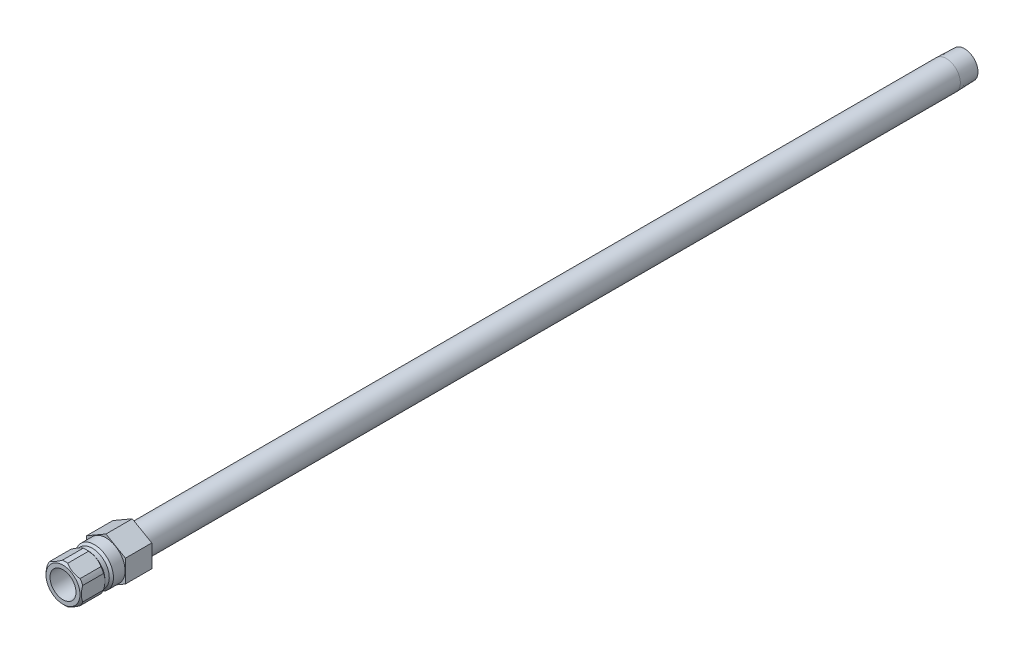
ISO-10303-21;
HEADER;
FILE_DESCRIPTION(('STEP AP214'),'2;1');
FILE_NAME('part.step','',(''),(''),'','','');
FILE_SCHEMA(('AUTOMOTIVE_DESIGN { 1 0 10303 214 1 1 1 1 }'));
ENDSEC;
DATA;
#1=APPLICATION_CONTEXT('core data for automotive mechanical design processes');
#2=APPLICATION_PROTOCOL_DEFINITION('international standard','automotive_design',2000,#1);
#3=PRODUCT_CONTEXT('',#1,'mechanical');
#4=PRODUCT('Part','Part','',(#3));
#5=PRODUCT_RELATED_PRODUCT_CATEGORY('part','',(#4));
#6=PRODUCT_DEFINITION_FORMATION('','',#4);
#7=PRODUCT_DEFINITION_CONTEXT('part definition',#1,'design');
#8=PRODUCT_DEFINITION('design','',#6,#7);
#9=PRODUCT_DEFINITION_SHAPE('','',#8);
#10=(LENGTH_UNIT() NAMED_UNIT(*) SI_UNIT(.MILLI.,.METRE.));
#11=(NAMED_UNIT(*) PLANE_ANGLE_UNIT() SI_UNIT($,.RADIAN.));
#12=(NAMED_UNIT(*) SI_UNIT($,.STERADIAN.) SOLID_ANGLE_UNIT());
#13=UNCERTAINTY_MEASURE_WITH_UNIT(LENGTH_MEASURE(1.E-05),#10,'distance_accuracy_value','');
#14=(GEOMETRIC_REPRESENTATION_CONTEXT(3) GLOBAL_UNCERTAINTY_ASSIGNED_CONTEXT((#13)) GLOBAL_UNIT_ASSIGNED_CONTEXT((#10,
#11,#12)) REPRESENTATION_CONTEXT('',''));
#15=CARTESIAN_POINT('',(0.,0.,0.));
#16=DIRECTION('',(0.,0.,1.));
#17=DIRECTION('',(1.,0.,0.));
#18=AXIS2_PLACEMENT_3D('',#15,#16,#17);
#19=CARTESIAN_POINT('',(0.,0.,-9.652));
#20=DIRECTION('',(0.,0.,-1.));
#21=DIRECTION('',(0.,1.,0.));
#22=AXIS2_PLACEMENT_3D('',#19,#20,#21);
#23=CYLINDRICAL_SURFACE('',#22,6.985);
#24=DIRECTION('',(0.,0.,-1.));
#25=VECTOR('',#24,1.);
#26=CARTESIAN_POINT('',(6.477,2.61509005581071,-9.652));
#27=LINE('',#26,#25);
#28=CARTESIAN_POINT('',(6.477,2.61509005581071,7.366));
#29=VERTEX_POINT('',#28);
#30=CARTESIAN_POINT('',(6.477,2.61509005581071,14.986));
#31=VERTEX_POINT('',#30);
#32=EDGE_CURVE('E372',#29,#31,#27,.F.);
#33=ORIENTED_EDGE('',*,*,#32,.F.);
#34=CARTESIAN_POINT('',(0.,0.,7.366));
#35=DIRECTION('',(0.,0.,-1.));
#36=DIRECTION('',(0.,1.,0.));
#37=AXIS2_PLACEMENT_3D('',#34,#35,#36);
#38=CIRCLE('',#37,6.985);
#39=CARTESIAN_POINT('',(5.50323442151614,4.30170151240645,7.366));
#40=VERTEX_POINT('',#39);
#41=EDGE_CURVE('E190',#40,#29,#38,.T.);
#42=ORIENTED_EDGE('',*,*,#41,.F.);
#43=DIRECTION('',(0.,0.,-1.));
#44=VECTOR('',#43,1.);
#45=CARTESIAN_POINT('',(5.50323442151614,4.30170151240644,-9.652));
#46=LINE('',#45,#44);
#47=CARTESIAN_POINT('',(5.50323442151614,4.30170151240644,14.986));
#48=VERTEX_POINT('',#47);
#49=EDGE_CURVE('E363',#48,#40,#46,.T.);
#50=ORIENTED_EDGE('',*,*,#49,.F.);
#51=CARTESIAN_POINT('',(0.,0.,14.986));
#52=DIRECTION('',(0.,0.,-1.));
#53=DIRECTION('',(0.,1.,0.));
#54=AXIS2_PLACEMENT_3D('',#51,#52,#53);
#55=CIRCLE('',#54,6.985);
#56=EDGE_CURVE('E205',#48,#31,#55,.T.);
#57=ORIENTED_EDGE('',*,*,#56,.T.);
#58=EDGE_LOOP('',(#33,#42,#50,#57));
#59=FACE_BOUND('',#58,.T.);
#60=ADVANCED_FACE('F34',(#59),#23,.T.);
#61=DIRECTION('',(0.,0.,-1.));
#62=VECTOR('',#61,1.);
#63=CARTESIAN_POINT('',(0.97376557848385,6.91679156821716,-9.652));
#64=LINE('',#63,#62);
#65=CARTESIAN_POINT('',(0.973765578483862,6.91679156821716,7.366));
#66=VERTEX_POINT('',#65);
#67=CARTESIAN_POINT('',(0.97376557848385,6.91679156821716,14.986));
#68=VERTEX_POINT('',#67);
#69=EDGE_CURVE('E283',#66,#68,#64,.F.);
#70=ORIENTED_EDGE('',*,*,#69,.F.);
#71=CARTESIAN_POINT('',(-0.973765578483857,6.91679156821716,7.366));
#72=VERTEX_POINT('',#71);
#73=EDGE_CURVE('E194',#72,#66,#38,.T.);
#74=ORIENTED_EDGE('',*,*,#73,.F.);
#75=DIRECTION('',(0.,0.,-1.));
#76=VECTOR('',#75,1.);
#77=CARTESIAN_POINT('',(-0.97376557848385,6.91679156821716,-9.652));
#78=LINE('',#77,#76);
#79=CARTESIAN_POINT('',(-0.97376557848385,6.91679156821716,14.986));
#80=VERTEX_POINT('',#79);
#81=EDGE_CURVE('E54',#80,#72,#78,.T.);
#82=ORIENTED_EDGE('',*,*,#81,.F.);
#83=EDGE_CURVE('E193',#80,#68,#55,.T.);
#84=ORIENTED_EDGE('',*,*,#83,.T.);
#85=EDGE_LOOP('',(#70,#74,#82,#84));
#86=FACE_BOUND('',#85,.T.);
#87=ADVANCED_FACE('F317',(#86),#23,.T.);
#88=DIRECTION('',(0.,0.,-1.));
#89=VECTOR('',#88,1.);
#90=CARTESIAN_POINT('',(-5.50323442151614,4.30170151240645,-9.652));
#91=LINE('',#90,#89);
#92=CARTESIAN_POINT('',(-5.50323442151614,4.30170151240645,7.366));
#93=VERTEX_POINT('',#92);
#94=CARTESIAN_POINT('',(-5.50323442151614,4.30170151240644,14.986));
#95=VERTEX_POINT('',#94);
#96=EDGE_CURVE('E361',#93,#95,#91,.F.);
#97=ORIENTED_EDGE('',*,*,#96,.F.);
#98=CARTESIAN_POINT('',(-6.477,2.6150900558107,7.366));
#99=VERTEX_POINT('',#98);
#100=EDGE_CURVE('E199',#99,#93,#38,.T.);
#101=ORIENTED_EDGE('',*,*,#100,.F.);
#102=DIRECTION('',(0.,0.,-1.));
#103=VECTOR('',#102,1.);
#104=CARTESIAN_POINT('',(-6.477,2.61509005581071,-9.652));
#105=LINE('',#104,#103);
#106=CARTESIAN_POINT('',(-6.477,2.6150900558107,14.986));
#107=VERTEX_POINT('',#106);
#108=EDGE_CURVE('E62',#107,#99,#105,.T.);
#109=ORIENTED_EDGE('',*,*,#108,.F.);
#110=EDGE_CURVE('E204',#107,#95,#55,.T.);
#111=ORIENTED_EDGE('',*,*,#110,.T.);
#112=EDGE_LOOP('',(#97,#101,#109,#111));
#113=FACE_BOUND('',#112,.T.);
#114=ADVANCED_FACE('F322',(#113),#23,.T.);
#115=DIRECTION('',(0.,0.,-1.));
#116=VECTOR('',#115,1.);
#117=CARTESIAN_POINT('',(-6.477,-2.61509005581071,-9.652));
#118=LINE('',#117,#116);
#119=CARTESIAN_POINT('',(-6.477,-2.61509005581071,7.366));
#120=VERTEX_POINT('',#119);
#121=CARTESIAN_POINT('',(-6.477,-2.61509005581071,14.986));
#122=VERTEX_POINT('',#121);
#123=EDGE_CURVE('E353',#120,#122,#118,.F.);
#124=ORIENTED_EDGE('',*,*,#123,.F.);
#125=CARTESIAN_POINT('',(-5.50323442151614,-4.30170151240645,7.366));
#126=VERTEX_POINT('',#125);
#127=EDGE_CURVE('E195',#126,#120,#38,.T.);
#128=ORIENTED_EDGE('',*,*,#127,.F.);
#129=DIRECTION('',(0.,0.,-1.));
#130=VECTOR('',#129,1.);
#131=CARTESIAN_POINT('',(-5.50323442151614,-4.30170151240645,-9.652));
#132=LINE('',#131,#130);
#133=CARTESIAN_POINT('',(-5.50323442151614,-4.30170151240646,14.986));
#134=VERTEX_POINT('',#133);
#135=EDGE_CURVE('E239',#134,#126,#132,.T.);
#136=ORIENTED_EDGE('',*,*,#135,.F.);
#137=EDGE_CURVE('E367',#134,#122,#55,.T.);
#138=ORIENTED_EDGE('',*,*,#137,.T.);
#139=EDGE_LOOP('',(#124,#128,#136,#138));
#140=FACE_BOUND('',#139,.T.);
#141=ADVANCED_FACE('F332',(#140),#23,.T.);
#142=DIRECTION('',(0.,0.,-1.));
#143=VECTOR('',#142,1.);
#144=CARTESIAN_POINT('',(-0.973765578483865,-6.91679156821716,-9.652));
#145=LINE('',#144,#143);
#146=CARTESIAN_POINT('',(-0.973765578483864,-6.91679156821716,7.366));
#147=VERTEX_POINT('',#146);
#148=CARTESIAN_POINT('',(-0.973765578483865,-6.91679156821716,14.986));
#149=VERTEX_POINT('',#148);
#150=EDGE_CURVE('E342',#147,#149,#145,.F.);
#151=ORIENTED_EDGE('',*,*,#150,.F.);
#152=CARTESIAN_POINT('',(0.973765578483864,-6.91679156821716,7.366));
#153=VERTEX_POINT('',#152);
#154=EDGE_CURVE('E191',#153,#147,#38,.T.);
#155=ORIENTED_EDGE('',*,*,#154,.F.);
#156=DIRECTION('',(0.,0.,-1.));
#157=VECTOR('',#156,1.);
#158=CARTESIAN_POINT('',(0.973765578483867,-6.91679156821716,-9.652));
#159=LINE('',#158,#157);
#160=CARTESIAN_POINT('',(0.973765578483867,-6.91679156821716,14.986));
#161=VERTEX_POINT('',#160);
#162=EDGE_CURVE('E168',#161,#153,#159,.T.);
#163=ORIENTED_EDGE('',*,*,#162,.F.);
#164=EDGE_CURVE('E344',#161,#149,#55,.T.);
#165=ORIENTED_EDGE('',*,*,#164,.T.);
#166=EDGE_LOOP('',(#151,#155,#163,#165));
#167=FACE_BOUND('',#166,.T.);
#168=ADVANCED_FACE('F326',(#167),#23,.T.);
#169=CARTESIAN_POINT('',(0.,0.,-9.652));
#170=DIRECTION('',(0.,0.,-1.));
#171=DIRECTION('',(0.,1.,0.));
#172=AXIS2_PLACEMENT_3D('',#169,#170,#171);
#173=CYLINDRICAL_SURFACE('',#172,4.7625);
#174=CARTESIAN_POINT('',(0.,0.,3.556));
#175=DIRECTION('',(0.,0.,-1.));
#176=DIRECTION('',(0.,1.,0.));
#177=AXIS2_PLACEMENT_3D('',#174,#175,#176);
#178=CIRCLE('',#177,4.7625);
#179=CARTESIAN_POINT('',(0.,4.7625,3.556));
#180=VERTEX_POINT('',#179);
#181=EDGE_CURVE('E420',#180,#180,#178,.T.);
#182=ORIENTED_EDGE('',*,*,#181,.T.);
#183=EDGE_LOOP('',(#182));
#184=FACE_BOUND('',#183,.T.);
#185=CARTESIAN_POINT('',(0.,0.,15.748));
#186=DIRECTION('',(0.,0.,-1.));
#187=DIRECTION('',(0.,1.,0.));
#188=AXIS2_PLACEMENT_3D('',#185,#186,#187);
#189=CIRCLE('',#188,4.7625);
#190=CARTESIAN_POINT('',(0.,4.7625,15.748));
#191=VERTEX_POINT('',#190);
#192=EDGE_CURVE('E209',#191,#191,#189,.T.);
#193=ORIENTED_EDGE('',*,*,#192,.F.);
#194=EDGE_LOOP('',(#193));
#195=FACE_BOUND('',#194,.T.);
#196=ADVANCED_FACE('F36',(#184,#195),#173,.F.);
#197=CARTESIAN_POINT('',(0.,4.7625,15.748));
#198=DIRECTION('',(0.,0.,1.));
#199=DIRECTION('',(0.,-1.,0.));
#200=AXIS2_PLACEMENT_3D('',#197,#198,#199);
#201=PLANE('',#200);
#202=ORIENTED_EDGE('',*,*,#192,.T.);
#203=EDGE_LOOP('',(#202));
#204=FACE_BOUND('',#203,.T.);
#205=CARTESIAN_POINT('',(0.,0.,15.748));
#206=DIRECTION('',(0.,0.,-1.));
#207=DIRECTION('',(0.,1.,0.));
#208=AXIS2_PLACEMENT_3D('',#205,#206,#207);
#209=CIRCLE('',#208,6.223);
#210=CARTESIAN_POINT('',(0.,6.223,15.748));
#211=VERTEX_POINT('',#210);
#212=EDGE_CURVE('E206',#211,#211,#209,.T.);
#213=ORIENTED_EDGE('',*,*,#212,.F.);
#214=EDGE_LOOP('',(#213));
#215=FACE_BOUND('',#214,.T.);
#216=ADVANCED_FACE('F245',(#204,#215),#201,.T.);
#217=CARTESIAN_POINT('',(0.,0.,14.986));
#218=DIRECTION('',(0.,0.,-1.));
#219=DIRECTION('',(0.,1.,0.));
#220=AXIS2_PLACEMENT_3D('',#217,#218,#219);
#221=CONICAL_SURFACE('',#220,6.985,0.785398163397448);
#222=CARTESIAN_POINT('',(6.477,-7.50531717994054,12.0573066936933));
#223=CARTESIAN_POINT('',(6.477,-7.32278230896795,12.1954662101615));
#224=CARTESIAN_POINT('',(6.477,-7.13923073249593,12.3323042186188));
#225=CARTESIAN_POINT('',(6.477,-6.76969107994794,12.6027438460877));
#226=CARTESIAN_POINT('',(6.477,-6.58370240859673,12.7363446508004));
#227=CARTESIAN_POINT('',(6.477,-6.20752484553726,13.0006667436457));
#228=CARTESIAN_POINT('',(6.477,-6.01731457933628,13.1313577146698));
#229=CARTESIAN_POINT('',(6.477,-5.63367369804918,13.3879087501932));
#230=CARTESIAN_POINT('',(6.477,-5.44024331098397,13.5137691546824));
#231=CARTESIAN_POINT('',(6.477,-5.03831720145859,13.7667102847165));
#232=CARTESIAN_POINT('',(6.477,-4.82959841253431,13.8934383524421));
#233=CARTESIAN_POINT('',(6.477,-4.4072839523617,14.1386241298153));
#234=CARTESIAN_POINT('',(6.477,-4.19368750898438,14.2570805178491));
#235=CARTESIAN_POINT('',(6.477,-3.76162676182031,14.4831715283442));
#236=CARTESIAN_POINT('',(6.477,-3.54317924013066,14.5908379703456));
#237=CARTESIAN_POINT('',(6.477,-3.10029556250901,14.7929384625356));
#238=CARTESIAN_POINT('',(6.477,-2.87586219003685,14.8873785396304));
#239=CARTESIAN_POINT('',(6.477,-2.43955826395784,15.0524966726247));
#240=CARTESIAN_POINT('',(6.477,-2.22819339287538,15.1244971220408));
#241=CARTESIAN_POINT('',(6.477,-1.80033354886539,15.2515475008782));
#242=CARTESIAN_POINT('',(6.477,-1.58383822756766,15.3065962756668));
#243=CARTESIAN_POINT('',(6.477,-1.1506339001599,15.3959385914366));
#244=CARTESIAN_POINT('',(6.477,-0.934000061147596,15.4305906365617));
#245=CARTESIAN_POINT('',(6.477,-0.498364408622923,15.4784594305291));
#246=CARTESIAN_POINT('',(6.477,-0.2793630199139,15.4916799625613));
#247=CARTESIAN_POINT('',(6.477,0.150697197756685,15.4956835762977));
#248=CARTESIAN_POINT('',(6.477,0.361748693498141,15.4872823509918));
#249=CARTESIAN_POINT('',(6.477,0.782066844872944,15.4503172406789));
#250=CARTESIAN_POINT('',(6.477,0.991333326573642,15.421751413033));
#251=CARTESIAN_POINT('',(6.477,1.41010575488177,15.3455375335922));
#252=CARTESIAN_POINT('',(6.477,1.6195513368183,15.2975631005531));
#253=CARTESIAN_POINT('',(6.477,2.03387291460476,15.1851046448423));
#254=CARTESIAN_POINT('',(6.477,2.23874927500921,15.1206219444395));
#255=CARTESIAN_POINT('',(6.477,2.66141718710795,14.9715598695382));
#256=CARTESIAN_POINT('',(6.477,2.87875617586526,14.8857103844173));
#257=CARTESIAN_POINT('',(6.477,3.30779766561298,14.7008180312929));
#258=CARTESIAN_POINT('',(6.477,3.51949749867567,14.6017690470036));
#259=CARTESIAN_POINT('',(6.477,3.93828980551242,14.3928329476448));
#260=CARTESIAN_POINT('',(6.477,4.14536521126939,14.282911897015));
#261=CARTESIAN_POINT('',(6.477,4.55475391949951,14.0546596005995));
#262=CARTESIAN_POINT('',(6.477,4.75706796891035,13.93632968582));
#263=CARTESIAN_POINT('',(6.477,5.14761370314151,13.6989609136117));
#264=CARTESIAN_POINT('',(6.477,5.33604552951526,13.580249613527));
#265=CARTESIAN_POINT('',(6.477,5.70967381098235,13.3378251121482));
#266=CARTESIAN_POINT('',(6.477,5.89487001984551,13.2141115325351));
#267=CARTESIAN_POINT('',(6.477,6.26095063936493,12.9635958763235));
#268=CARTESIAN_POINT('',(6.477,6.4418578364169,12.8368269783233));
#269=CARTESIAN_POINT('',(6.477,6.80119835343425,12.5799293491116));
#270=CARTESIAN_POINT('',(6.477,6.97963234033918,12.4498015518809));
#271=CARTESIAN_POINT('',(6.477,7.15703038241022,12.3183002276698));
#272=B_SPLINE_CURVE_WITH_KNOTS('',3,(#222,#223,#224,#225,#226,#227,#228,#229,#230,#231,#232,
#233,#234,#235,#236,#237,#238,#239,#240,#241,#242,#243,#244,#245,#246,#247,#248,#249,#250,#251,
#252,#253,#254,#255,#256,#257,#258,#259,#260,#261,#262,#263,#264,#265,#266,#267,#268,#269,#270,
#271),.UNSPECIFIED.,.F.,.F.,(4,2,2,2,2,2,2,2,2,2,2,2,2,2,2,2,2,2,2,2,2,2,2,2,4),(0.,
0.68679090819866,1.37375281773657,2.06603541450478,2.75826919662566,3.49065471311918,
4.22315698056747,4.95343127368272,5.68337170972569,6.35265989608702,7.02199365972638,
7.67918147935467,8.33625327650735,8.96890298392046,9.60161364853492,10.2454384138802,
10.8892116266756,11.5897073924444,12.2905288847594,12.9936114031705,13.696582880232,
14.3646145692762,15.0326968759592,15.6953618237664,16.3578444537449),.UNSPECIFIED.);
#273=CARTESIAN_POINT('',(6.477,-2.61509005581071,14.986));
#274=VERTEX_POINT('',#273);
#275=EDGE_CURVE('E375',#31,#274,#272,.F.);
#276=ORIENTED_EDGE('',*,*,#275,.F.);
#277=ORIENTED_EDGE('',*,*,#56,.F.);
#278=CARTESIAN_POINT('',(0.973302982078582,6.91705864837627,14.9858));
#279=CARTESIAN_POINT('',(1.1543052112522,6.81255696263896,15.0641166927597));
#280=CARTESIAN_POINT('',(1.3378209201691,6.70660411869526,15.1353544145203));
#281=CARTESIAN_POINT('',(1.70963160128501,6.49193912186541,15.2608524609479));
#282=CARTESIAN_POINT('',(1.89793754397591,6.38322063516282,15.3150691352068));
#283=CARTESIAN_POINT('',(2.27146153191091,6.16756646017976,15.401724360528));
#284=CARTESIAN_POINT('',(2.45655498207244,6.06070270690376,15.4348622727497));
#285=CARTESIAN_POINT('',(2.82844640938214,5.8459910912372,15.4802195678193));
#286=CARTESIAN_POINT('',(3.0152419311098,5.73814464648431,15.4924653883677));
#287=CARTESIAN_POINT('',(3.3948057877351,5.51900335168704,15.4953056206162));
#288=CARTESIAN_POINT('',(3.58757842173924,5.40770601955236,15.4852117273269));
#289=CARTESIAN_POINT('',(3.97148128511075,5.18605959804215,15.4426708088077));
#290=CARTESIAN_POINT('',(4.16260891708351,5.0757120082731,15.4101933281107));
#291=CARTESIAN_POINT('',(4.54854122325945,4.85289388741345,15.3234273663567));
#292=CARTESIAN_POINT('',(4.74321398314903,4.74049951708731,15.268364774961));
#293=CARTESIAN_POINT('',(5.03141021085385,4.5741093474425,15.1720079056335));
#294=CARTESIAN_POINT('',(5.12673323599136,4.51907457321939,15.1376422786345));
#295=CARTESIAN_POINT('',(5.31613879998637,4.40972121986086,15.0647445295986));
#296=CARTESIAN_POINT('',(5.41022179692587,4.35540237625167,15.0262139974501));
#297=CARTESIAN_POINT('',(5.50369701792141,4.30143443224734,14.9858));
#298=B_SPLINE_CURVE_WITH_KNOTS('',3,(#278,#279,#280,#281,#282,#283,#284,#285,#286,#287,#288,
#289,#290,#291,#292,#293,#294,#295,#296,#297),.UNSPECIFIED.,.F.,.F.,(4,2,2,2,2,2,2,2,2,4),(0.,
0.669810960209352,1.34132587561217,1.98920541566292,2.63626449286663,3.30353665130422,
3.97171850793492,4.66502165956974,5.01088265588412,5.35661208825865),.UNSPECIFIED.);
#299=EDGE_CURVE('E275',#68,#48,#298,.T.);
#300=ORIENTED_EDGE('',*,*,#299,.F.);
#301=ORIENTED_EDGE('',*,*,#83,.F.);
#302=CARTESIAN_POINT('',(-5.50369701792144,4.30143443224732,14.9858));
#303=CARTESIAN_POINT('',(-5.32269478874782,4.40593611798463,15.0641166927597));
#304=CARTESIAN_POINT('',(-5.13917907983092,4.51188896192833,15.1353544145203));
#305=CARTESIAN_POINT('',(-4.76736839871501,4.72655395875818,15.2608524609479));
#306=CARTESIAN_POINT('',(-4.57906245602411,4.83527244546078,15.3150691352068));
#307=CARTESIAN_POINT('',(-4.2055384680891,5.05092662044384,15.401724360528));
#308=CARTESIAN_POINT('',(-4.02044501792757,5.15779037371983,15.4348622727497));
#309=CARTESIAN_POINT('',(-3.64855359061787,5.3725019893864,15.4802195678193));
#310=CARTESIAN_POINT('',(-3.46175806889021,5.48034843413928,15.4924653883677));
#311=CARTESIAN_POINT('',(-3.0821942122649,5.69948972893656,15.4953056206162));
#312=CARTESIAN_POINT('',(-2.88942157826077,5.81078706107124,15.4852117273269));
#313=CARTESIAN_POINT('',(-2.50551871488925,6.03243348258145,15.4426708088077));
#314=CARTESIAN_POINT('',(-2.31439108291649,6.1427810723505,15.4101933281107));
#315=CARTESIAN_POINT('',(-1.92845877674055,6.36559919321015,15.3234273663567));
#316=CARTESIAN_POINT('',(-1.73378601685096,6.47799356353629,15.268364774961));
#317=CARTESIAN_POINT('',(-1.44558978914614,6.64438373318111,15.1720079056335));
#318=CARTESIAN_POINT('',(-1.35026676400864,6.69941850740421,15.1376422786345));
#319=CARTESIAN_POINT('',(-1.16086120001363,6.80877186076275,15.0647445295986));
#320=CARTESIAN_POINT('',(-1.06677820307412,6.86309070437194,15.0262139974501));
#321=CARTESIAN_POINT('',(-0.973302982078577,6.91705864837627,14.9858));
#322=B_SPLINE_CURVE_WITH_KNOTS('',3,(#302,#303,#304,#305,#306,#307,#308,#309,#310,#311,#312,
#313,#314,#315,#316,#317,#318,#319,#320,#321),.UNSPECIFIED.,.F.,.F.,(4,2,2,2,2,2,2,2,2,4),(0.,
0.669810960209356,1.34132587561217,1.98920541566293,2.63626449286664,3.30353665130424,
3.97171850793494,4.66502165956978,5.01088265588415,5.35661208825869),.UNSPECIFIED.);
#323=EDGE_CURVE('E267',#95,#80,#322,.T.);
#324=ORIENTED_EDGE('',*,*,#323,.F.);
#325=ORIENTED_EDGE('',*,*,#110,.F.);
#326=CARTESIAN_POINT('',(-6.477,-7.50531717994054,12.0573066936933));
#327=CARTESIAN_POINT('',(-6.477,-7.32278230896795,12.1954662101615));
#328=CARTESIAN_POINT('',(-6.477,-7.13923073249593,12.3323042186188));
#329=CARTESIAN_POINT('',(-6.477,-6.76969107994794,12.6027438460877));
#330=CARTESIAN_POINT('',(-6.477,-6.58370240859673,12.7363446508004));
#331=CARTESIAN_POINT('',(-6.477,-6.20752484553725,13.0006667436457));
#332=CARTESIAN_POINT('',(-6.477,-6.01731457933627,13.1313577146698));
#333=CARTESIAN_POINT('',(-6.477,-5.63367369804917,13.3879087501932));
#334=CARTESIAN_POINT('',(-6.477,-5.44024331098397,13.5137691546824));
#335=CARTESIAN_POINT('',(-6.477,-5.03831720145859,13.7667102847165));
#336=CARTESIAN_POINT('',(-6.477,-4.8295984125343,13.8934383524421));
#337=CARTESIAN_POINT('',(-6.477,-4.4072839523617,14.1386241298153));
#338=CARTESIAN_POINT('',(-6.477,-4.19368750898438,14.2570805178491));
#339=CARTESIAN_POINT('',(-6.477,-3.7616267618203,14.4831715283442));
#340=CARTESIAN_POINT('',(-6.477,-3.54317924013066,14.5908379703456));
#341=CARTESIAN_POINT('',(-6.477,-3.100295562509,14.7929384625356));
#342=CARTESIAN_POINT('',(-6.477,-2.87586219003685,14.8873785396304));
#343=CARTESIAN_POINT('',(-6.477,-2.43955826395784,15.0524966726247));
#344=CARTESIAN_POINT('',(-6.477,-2.22819339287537,15.1244971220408));
#345=CARTESIAN_POINT('',(-6.477,-1.80033354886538,15.2515475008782));
#346=CARTESIAN_POINT('',(-6.477,-1.58383822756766,15.3065962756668));
#347=CARTESIAN_POINT('',(-6.477,-1.15063390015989,15.3959385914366));
#348=CARTESIAN_POINT('',(-6.477,-0.934000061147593,15.4305906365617));
#349=CARTESIAN_POINT('',(-6.477,-0.498364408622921,15.4784594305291));
#350=CARTESIAN_POINT('',(-6.477,-0.279363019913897,15.4916799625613));
#351=CARTESIAN_POINT('',(-6.477,0.150697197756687,15.4956835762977));
#352=CARTESIAN_POINT('',(-6.477,0.361748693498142,15.4872823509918));
#353=CARTESIAN_POINT('',(-6.477,0.782066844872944,15.4503172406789));
#354=CARTESIAN_POINT('',(-6.477,0.991333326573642,15.421751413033));
#355=CARTESIAN_POINT('',(-6.477,1.41010575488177,15.3455375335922));
#356=CARTESIAN_POINT('',(-6.477,1.6195513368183,15.2975631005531));
#357=CARTESIAN_POINT('',(-6.477,2.03387291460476,15.1851046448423));
#358=CARTESIAN_POINT('',(-6.477,2.23874927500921,15.1206219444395));
#359=CARTESIAN_POINT('',(-6.477,2.66141718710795,14.9715598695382));
#360=CARTESIAN_POINT('',(-6.477,2.87875617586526,14.8857103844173));
#361=CARTESIAN_POINT('',(-6.477,3.30779766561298,14.7008180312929));
#362=CARTESIAN_POINT('',(-6.477,3.51949749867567,14.6017690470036));
#363=CARTESIAN_POINT('',(-6.477,3.93828980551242,14.3928329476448));
#364=CARTESIAN_POINT('',(-6.477,4.14536521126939,14.282911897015));
#365=CARTESIAN_POINT('',(-6.477,4.55475391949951,14.0546596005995));
#366=CARTESIAN_POINT('',(-6.477,4.75706796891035,13.93632968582));
#367=CARTESIAN_POINT('',(-6.477,5.14761370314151,13.6989609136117));
#368=CARTESIAN_POINT('',(-6.477,5.33604552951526,13.580249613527));
#369=CARTESIAN_POINT('',(-6.477,5.70967381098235,13.3378251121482));
#370=CARTESIAN_POINT('',(-6.477,5.89487001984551,13.2141115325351));
#371=CARTESIAN_POINT('',(-6.477,6.26095063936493,12.9635958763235));
#372=CARTESIAN_POINT('',(-6.477,6.4418578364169,12.8368269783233));
#373=CARTESIAN_POINT('',(-6.477,6.80119835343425,12.5799293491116));
#374=CARTESIAN_POINT('',(-6.477,6.97963234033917,12.4498015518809));
#375=CARTESIAN_POINT('',(-6.477,7.15703038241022,12.3183002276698));
#376=B_SPLINE_CURVE_WITH_KNOTS('',3,(#326,#327,#328,#329,#330,#331,#332,#333,#334,#335,#336,
#337,#338,#339,#340,#341,#342,#343,#344,#345,#346,#347,#348,#349,#350,#351,#352,#353,#354,#355,
#356,#357,#358,#359,#360,#361,#362,#363,#364,#365,#366,#367,#368,#369,#370,#371,#372,#373,#374,
#375),.UNSPECIFIED.,.F.,.F.,(4,2,2,2,2,2,2,2,2,2,2,2,2,2,2,2,2,2,2,2,2,2,2,2,4),(0.,
0.686790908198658,1.37375281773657,2.06603541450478,2.75826919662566,3.49065471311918,
4.22315698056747,4.95343127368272,5.68337170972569,6.35265989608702,7.02199365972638,
7.67918147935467,8.33625327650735,8.96890298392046,9.60161364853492,10.2454384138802,
10.8892116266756,11.5897073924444,12.2905288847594,12.9936114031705,13.696582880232,
14.3646145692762,15.0326968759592,15.6953618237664,16.3578444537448),.UNSPECIFIED.);
#377=EDGE_CURVE('E260',#122,#107,#376,.T.);
#378=ORIENTED_EDGE('',*,*,#377,.F.);
#379=ORIENTED_EDGE('',*,*,#137,.F.);
#380=CARTESIAN_POINT('',(-0.973302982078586,-6.91705864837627,14.9858));
#381=CARTESIAN_POINT('',(-1.1543052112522,-6.81255696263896,15.0641166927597));
#382=CARTESIAN_POINT('',(-1.3378209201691,-6.70660411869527,15.1353544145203));
#383=CARTESIAN_POINT('',(-1.70963160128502,-6.49193912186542,15.2608524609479));
#384=CARTESIAN_POINT('',(-1.89793754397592,-6.38322063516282,15.3150691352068));
#385=CARTESIAN_POINT('',(-2.27146153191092,-6.16756646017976,15.401724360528));
#386=CARTESIAN_POINT('',(-2.45655498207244,-6.06070270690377,15.4348622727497));
#387=CARTESIAN_POINT('',(-2.82844640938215,-5.8459910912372,15.4802195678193));
#388=CARTESIAN_POINT('',(-3.0152419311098,-5.73814464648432,15.4924653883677));
#389=CARTESIAN_POINT('',(-3.39480578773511,-5.51900335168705,15.4953056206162));
#390=CARTESIAN_POINT('',(-3.58757842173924,-5.40770601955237,15.4852117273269));
#391=CARTESIAN_POINT('',(-3.97148128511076,-5.18605959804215,15.4426708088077));
#392=CARTESIAN_POINT('',(-4.16260891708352,-5.0757120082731,15.4101933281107));
#393=CARTESIAN_POINT('',(-4.54854122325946,-4.85289388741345,15.3234273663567));
#394=CARTESIAN_POINT('',(-4.74321398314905,-4.74049951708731,15.268364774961));
#395=CARTESIAN_POINT('',(-5.03141021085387,-4.57410934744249,15.1720079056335));
#396=CARTESIAN_POINT('',(-5.12673323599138,-4.51907457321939,15.1376422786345));
#397=CARTESIAN_POINT('',(-5.31613879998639,-4.40972121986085,15.0647445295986));
#398=CARTESIAN_POINT('',(-5.4102217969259,-4.35540237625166,15.0262139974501));
#399=CARTESIAN_POINT('',(-5.50369701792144,-4.30143443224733,14.9858));
#400=B_SPLINE_CURVE_WITH_KNOTS('',3,(#380,#381,#382,#383,#384,#385,#386,#387,#388,#389,#390,
#391,#392,#393,#394,#395,#396,#397,#398,#399),.UNSPECIFIED.,.F.,.F.,(4,2,2,2,2,2,2,2,2,4),(0.,
0.669810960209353,1.34132587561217,1.98920541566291,2.63626449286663,3.30353665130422,
3.97171850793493,4.66502165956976,5.01088265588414,5.35661208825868),.UNSPECIFIED.);
#401=EDGE_CURVE('E253',#149,#134,#400,.T.);
#402=ORIENTED_EDGE('',*,*,#401,.F.);
#403=ORIENTED_EDGE('',*,*,#164,.F.);
#404=CARTESIAN_POINT('',(5.50369701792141,-4.30143443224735,14.9858));
#405=CARTESIAN_POINT('',(5.32269478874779,-4.40593611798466,15.0641166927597));
#406=CARTESIAN_POINT('',(5.13917907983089,-4.51188896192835,15.1353544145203));
#407=CARTESIAN_POINT('',(4.76736839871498,-4.7265539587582,15.2608524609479));
#408=CARTESIAN_POINT('',(4.57906245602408,-4.8352724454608,15.3150691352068));
#409=CARTESIAN_POINT('',(4.20553846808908,-5.05092662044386,15.401724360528));
#410=CARTESIAN_POINT('',(4.02044501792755,-5.15779037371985,15.4348622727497));
#411=CARTESIAN_POINT('',(3.64855359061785,-5.37250198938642,15.4802195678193));
#412=CARTESIAN_POINT('',(3.46175806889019,-5.4803484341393,15.4924653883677));
#413=CARTESIAN_POINT('',(3.08219421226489,-5.69948972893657,15.4953056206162));
#414=CARTESIAN_POINT('',(2.88942157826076,-5.81078706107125,15.4852117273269));
#415=CARTESIAN_POINT('',(2.50551871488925,-6.03243348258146,15.4426708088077));
#416=CARTESIAN_POINT('',(2.31439108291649,-6.14278107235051,15.4101933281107));
#417=CARTESIAN_POINT('',(1.92845877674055,-6.36559919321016,15.3234273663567));
#418=CARTESIAN_POINT('',(1.73378601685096,-6.4779935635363,15.268364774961));
#419=CARTESIAN_POINT('',(1.44558978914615,-6.64438373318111,15.1720079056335));
#420=CARTESIAN_POINT('',(1.35026676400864,-6.69941850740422,15.1376422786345));
#421=CARTESIAN_POINT('',(1.16086120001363,-6.80877186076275,15.0647445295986));
#422=CARTESIAN_POINT('',(1.06677820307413,-6.86309070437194,15.0262139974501));
#423=CARTESIAN_POINT('',(0.973302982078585,-6.91705864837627,14.9858));
#424=B_SPLINE_CURVE_WITH_KNOTS('',3,(#404,#405,#406,#407,#408,#409,#410,#411,#412,#413,#414,
#415,#416,#417,#418,#419,#420,#421,#422,#423),.UNSPECIFIED.,.F.,.F.,(4,2,2,2,2,2,2,2,2,4),(0.,
0.669810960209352,1.34132587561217,1.98920541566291,2.63626449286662,3.30353665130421,
3.9717185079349,4.66502165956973,5.0108826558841,5.35661208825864),.UNSPECIFIED.);
#425=CARTESIAN_POINT('',(5.50323442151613,-4.30170151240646,14.986));
#426=VERTEX_POINT('',#425);
#427=EDGE_CURVE('E184',#426,#161,#424,.T.);
#428=ORIENTED_EDGE('',*,*,#427,.F.);
#429=EDGE_CURVE('E183',#274,#426,#55,.T.);
#430=ORIENTED_EDGE('',*,*,#429,.F.);
#431=EDGE_LOOP('',(#276,#277,#300,#301,#324,#325,#378,#379,#402,#403,#428,#430));
#432=FACE_BOUND('',#431,.T.);
#433=ORIENTED_EDGE('',*,*,#212,.T.);
#434=EDGE_LOOP('',(#433));
#435=FACE_BOUND('',#434,.T.);
#436=ADVANCED_FACE('F242',(#432,#435),#221,.T.);
#437=DIRECTION('',(0.,0.,-1.));
#438=VECTOR('',#437,1.);
#439=CARTESIAN_POINT('',(6.477,-2.61509005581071,-9.652));
#440=LINE('',#439,#438);
#441=CARTESIAN_POINT('',(6.477,-2.61509005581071,7.366));
#442=VERTEX_POINT('',#441);
#443=EDGE_CURVE('E282',#274,#442,#440,.T.);
#444=ORIENTED_EDGE('',*,*,#443,.F.);
#445=ORIENTED_EDGE('',*,*,#429,.T.);
#446=DIRECTION('',(0.,0.,-1.));
#447=VECTOR('',#446,1.);
#448=CARTESIAN_POINT('',(5.50323442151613,-4.30170151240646,-9.652));
#449=LINE('',#448,#447);
#450=CARTESIAN_POINT('',(5.50323442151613,-4.30170151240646,7.366));
#451=VERTEX_POINT('',#450);
#452=EDGE_CURVE('E165',#451,#426,#449,.F.);
#453=ORIENTED_EDGE('',*,*,#452,.F.);
#454=EDGE_CURVE('E181',#442,#451,#38,.T.);
#455=ORIENTED_EDGE('',*,*,#454,.F.);
#456=EDGE_LOOP('',(#444,#445,#453,#455));
#457=FACE_BOUND('',#456,.T.);
#458=ADVANCED_FACE('F180',(#457),#23,.T.);
#459=CARTESIAN_POINT('',(0.,0.,6.604));
#460=DIRECTION('',(0.,0.,1.));
#461=DIRECTION('',(0.,-1.,0.));
#462=AXIS2_PLACEMENT_3D('',#459,#460,#461);
#463=CONICAL_SURFACE('',#462,6.223,0.785398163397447);
#464=CARTESIAN_POINT('',(6.477,-7.50531717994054,10.2946933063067));
#465=CARTESIAN_POINT('',(6.477,-7.32278230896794,10.1565337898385));
#466=CARTESIAN_POINT('',(6.477,-7.13923073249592,10.0196957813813));
#467=CARTESIAN_POINT('',(6.477,-6.76969107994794,9.74925615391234));
#468=CARTESIAN_POINT('',(6.477,-6.58370240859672,9.61565534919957));
#469=CARTESIAN_POINT('',(6.477,-6.20752484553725,9.35133325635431));
#470=CARTESIAN_POINT('',(6.477,-6.01731457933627,9.22064228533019));
#471=CARTESIAN_POINT('',(6.477,-5.63367369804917,8.96409124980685));
#472=CARTESIAN_POINT('',(6.477,-5.44024331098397,8.83823084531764));
#473=CARTESIAN_POINT('',(6.477,-5.03831720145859,8.58528971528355));
#474=CARTESIAN_POINT('',(6.477,-4.82959841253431,8.45856164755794));
#475=CARTESIAN_POINT('',(6.477,-4.4072839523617,8.21337587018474));
#476=CARTESIAN_POINT('',(6.477,-4.19368750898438,8.09491948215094));
#477=CARTESIAN_POINT('',(6.477,-3.76162676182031,7.8688284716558));
#478=CARTESIAN_POINT('',(6.477,-3.54317924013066,7.76116202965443));
#479=CARTESIAN_POINT('',(6.477,-3.10029556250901,7.55906153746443));
#480=CARTESIAN_POINT('',(6.477,-2.87586219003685,7.46462146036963));
#481=CARTESIAN_POINT('',(6.477,-2.43955826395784,7.2995033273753));
#482=CARTESIAN_POINT('',(6.477,-2.22819339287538,7.2275028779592));
#483=CARTESIAN_POINT('',(6.477,-1.80033354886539,7.10045249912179));
#484=CARTESIAN_POINT('',(6.477,-1.58383822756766,7.0454037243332));
#485=CARTESIAN_POINT('',(6.477,-1.1506339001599,6.95606140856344));
#486=CARTESIAN_POINT('',(6.477,-0.934000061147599,6.92140936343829));
#487=CARTESIAN_POINT('',(6.477,-0.498364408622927,6.87354056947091));
#488=CARTESIAN_POINT('',(6.477,-0.279363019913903,6.86032003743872));
#489=CARTESIAN_POINT('',(6.477,0.15069719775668,6.85631642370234));
#490=CARTESIAN_POINT('',(6.477,0.361748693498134,6.8647176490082));
#491=CARTESIAN_POINT('',(6.477,0.782066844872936,6.90168275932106));
#492=CARTESIAN_POINT('',(6.477,0.991333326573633,6.93024858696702));
#493=CARTESIAN_POINT('',(6.477,1.41010575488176,7.00646246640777));
#494=CARTESIAN_POINT('',(6.477,1.61955133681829,7.05443689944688));
#495=CARTESIAN_POINT('',(6.477,2.03387291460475,7.16689535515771));
#496=CARTESIAN_POINT('',(6.477,2.2387492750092,7.23137805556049));
#497=CARTESIAN_POINT('',(6.477,2.66141718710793,7.38044013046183));
#498=CARTESIAN_POINT('',(6.477,2.87875617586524,7.46628961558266));
#499=CARTESIAN_POINT('',(6.477,3.30779766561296,7.65118196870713));
#500=CARTESIAN_POINT('',(6.477,3.51949749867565,7.75023095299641));
#501=CARTESIAN_POINT('',(6.477,3.93828980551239,7.95916705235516));
#502=CARTESIAN_POINT('',(6.477,4.14536521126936,8.069088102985));
#503=CARTESIAN_POINT('',(6.477,4.55475391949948,8.29734039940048));
#504=CARTESIAN_POINT('',(6.477,4.75706796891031,8.41567031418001));
#505=CARTESIAN_POINT('',(6.477,5.14761370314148,8.65303908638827));
#506=CARTESIAN_POINT('',(6.477,5.33604552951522,8.77175038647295));
#507=CARTESIAN_POINT('',(6.477,5.70967381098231,9.01417488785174));
#508=CARTESIAN_POINT('',(6.477,5.89487001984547,9.13788846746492));
#509=CARTESIAN_POINT('',(6.477,6.26095063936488,9.38840412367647));
#510=CARTESIAN_POINT('',(6.477,6.44185783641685,9.5151730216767));
#511=CARTESIAN_POINT('',(6.477,6.8011983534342,9.77207065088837));
#512=CARTESIAN_POINT('',(6.477,6.97963234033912,9.90219844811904));
#513=CARTESIAN_POINT('',(6.477,7.15703038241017,10.0336997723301));
#514=B_SPLINE_CURVE_WITH_KNOTS('',3,(#464,#465,#466,#467,#468,#469,#470,#471,#472,#473,#474,
#475,#476,#477,#478,#479,#480,#481,#482,#483,#484,#485,#486,#487,#488,#489,#490,#491,#492,#493,
#494,#495,#496,#497,#498,#499,#500,#501,#502,#503,#504,#505,#506,#507,#508,#509,#510,#511,#512,
#513),.UNSPECIFIED.,.F.,.F.,(4,2,2,2,2,2,2,2,2,2,2,2,2,2,2,2,2,2,2,2,2,2,2,2,4),(0.,
0.686790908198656,1.37375281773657,2.06603541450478,2.75826919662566,3.49065471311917,
4.22315698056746,4.95343127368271,5.68337170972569,6.35265989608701,7.02199365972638,
7.67918147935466,8.33625327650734,8.96890298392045,9.6016136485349,10.2454384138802,
10.8892116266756,11.5897073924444,12.2905288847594,12.9936114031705,13.6965828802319,
14.3646145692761,15.0326968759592,15.6953618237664,16.3578444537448),.UNSPECIFIED.);
#515=EDGE_CURVE('E12',#442,#29,#514,.T.);
#516=ORIENTED_EDGE('',*,*,#515,.F.);
#517=ORIENTED_EDGE('',*,*,#454,.T.);
#518=CARTESIAN_POINT('',(0.973302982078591,-6.91705864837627,7.3662));
#519=CARTESIAN_POINT('',(1.15430521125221,-6.81255696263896,7.28788330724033));
#520=CARTESIAN_POINT('',(1.33782092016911,-6.70660411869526,7.21664558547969));
#521=CARTESIAN_POINT('',(1.70963160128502,-6.49193912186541,7.09114753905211));
#522=CARTESIAN_POINT('',(1.89793754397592,-6.38322063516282,7.03693086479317));
#523=CARTESIAN_POINT('',(2.27146153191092,-6.16756646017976,6.95027563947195));
#524=CARTESIAN_POINT('',(2.45655498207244,-6.06070270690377,6.91713772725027));
#525=CARTESIAN_POINT('',(2.82844640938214,-5.8459910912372,6.87178043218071));
#526=CARTESIAN_POINT('',(3.0152419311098,-5.73814464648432,6.85953461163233));
#527=CARTESIAN_POINT('',(3.3948057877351,-5.51900335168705,6.85669437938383));
#528=CARTESIAN_POINT('',(3.58757842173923,-5.40770601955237,6.86678827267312));
#529=CARTESIAN_POINT('',(3.97148128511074,-5.18605959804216,6.90932919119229));
#530=CARTESIAN_POINT('',(4.1626089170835,-5.07571200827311,6.94180667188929));
#531=CARTESIAN_POINT('',(4.54854122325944,-4.85289388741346,7.02857263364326));
#532=CARTESIAN_POINT('',(4.74321398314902,-4.74049951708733,7.08363522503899));
#533=CARTESIAN_POINT('',(5.03141021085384,-4.57410934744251,7.17999209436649));
#534=CARTESIAN_POINT('',(5.12673323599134,-4.51907457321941,7.21435772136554));
#535=CARTESIAN_POINT('',(5.31613879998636,-4.40972121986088,7.28725547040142));
#536=CARTESIAN_POINT('',(5.41022179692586,-4.35540237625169,7.32578600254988));
#537=CARTESIAN_POINT('',(5.5036970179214,-4.30143443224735,7.3662));
#538=B_SPLINE_CURVE_WITH_KNOTS('',3,(#518,#519,#520,#521,#522,#523,#524,#525,#526,#527,#528,
#529,#530,#531,#532,#533,#534,#535,#536,#537),.UNSPECIFIED.,.F.,.F.,(4,2,2,2,2,2,2,2,2,4),(0.,
0.669810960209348,1.34132587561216,1.98920541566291,2.63626449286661,3.3035366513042,
3.97171850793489,4.66502165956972,5.01088265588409,5.35661208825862),.UNSPECIFIED.);
#539=EDGE_CURVE('E162',#153,#451,#538,.T.);
#540=ORIENTED_EDGE('',*,*,#539,.F.);
#541=ORIENTED_EDGE('',*,*,#154,.T.);
#542=CARTESIAN_POINT('',(-5.50369701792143,-4.30143443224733,7.36620000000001));
#543=CARTESIAN_POINT('',(-5.32269478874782,-4.40593611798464,7.28788330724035));
#544=CARTESIAN_POINT('',(-5.13917907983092,-4.51188896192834,7.2166455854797));
#545=CARTESIAN_POINT('',(-4.767368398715,-4.72655395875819,7.09114753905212));
#546=CARTESIAN_POINT('',(-4.5790624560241,-4.83527244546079,7.03693086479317));
#547=CARTESIAN_POINT('',(-4.2055384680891,-5.05092662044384,6.95027563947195));
#548=CARTESIAN_POINT('',(-4.02044501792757,-5.15779037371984,6.91713772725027));
#549=CARTESIAN_POINT('',(-3.64855359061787,-5.37250198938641,6.87178043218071));
#550=CARTESIAN_POINT('',(-3.46175806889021,-5.48034843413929,6.85953461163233));
#551=CARTESIAN_POINT('',(-3.08219421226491,-5.69948972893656,6.85669437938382));
#552=CARTESIAN_POINT('',(-2.88942157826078,-5.81078706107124,6.86678827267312));
#553=CARTESIAN_POINT('',(-2.50551871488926,-6.03243348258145,6.90932919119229));
#554=CARTESIAN_POINT('',(-2.3143910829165,-6.1427810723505,6.94180667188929));
#555=CARTESIAN_POINT('',(-1.92845877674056,-6.36559919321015,7.02857263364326));
#556=CARTESIAN_POINT('',(-1.73378601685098,-6.47799356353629,7.08363522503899));
#557=CARTESIAN_POINT('',(-1.44558978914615,-6.6443837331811,7.17999209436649));
#558=CARTESIAN_POINT('',(-1.35026676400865,-6.69941850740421,7.21435772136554));
#559=CARTESIAN_POINT('',(-1.16086120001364,-6.80877186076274,7.28725547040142));
#560=CARTESIAN_POINT('',(-1.06677820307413,-6.86309070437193,7.32578600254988));
#561=CARTESIAN_POINT('',(-0.973302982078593,-6.91705864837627,7.3662));
#562=B_SPLINE_CURVE_WITH_KNOTS('',3,(#542,#543,#544,#545,#546,#547,#548,#549,#550,#551,#552,
#553,#554,#555,#556,#557,#558,#559,#560,#561),.UNSPECIFIED.,.F.,.F.,(4,2,2,2,2,2,2,2,2,4),(0.,
0.669810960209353,1.34132587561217,1.98920541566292,2.63626449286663,3.30353665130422,
3.97171850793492,4.66502165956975,5.01088265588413,5.35661208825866),.UNSPECIFIED.);
#563=EDGE_CURVE('E173',#126,#147,#562,.T.);
#564=ORIENTED_EDGE('',*,*,#563,.F.);
#565=ORIENTED_EDGE('',*,*,#127,.T.);
#566=CARTESIAN_POINT('',(-6.477,-7.50531717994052,10.2946933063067));
#567=CARTESIAN_POINT('',(-6.477,-7.32278230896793,10.1565337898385));
#568=CARTESIAN_POINT('',(-6.477,-7.13923073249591,10.0196957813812));
#569=CARTESIAN_POINT('',(-6.477,-6.76969107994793,9.74925615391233));
#570=CARTESIAN_POINT('',(-6.477,-6.58370240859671,9.61565534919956));
#571=CARTESIAN_POINT('',(-6.477,-6.20752484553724,9.35133325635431));
#572=CARTESIAN_POINT('',(-6.477,-6.01731457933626,9.22064228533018));
#573=CARTESIAN_POINT('',(-6.477,-5.63367369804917,8.96409124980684));
#574=CARTESIAN_POINT('',(-6.477,-5.44024331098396,8.83823084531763));
#575=CARTESIAN_POINT('',(-6.477,-5.03831720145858,8.58528971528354));
#576=CARTESIAN_POINT('',(-6.477,-4.8295984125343,8.45856164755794));
#577=CARTESIAN_POINT('',(-6.477,-4.4072839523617,8.21337587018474));
#578=CARTESIAN_POINT('',(-6.477,-4.19368750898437,8.09491948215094));
#579=CARTESIAN_POINT('',(-6.477,-3.7616267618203,7.8688284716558));
#580=CARTESIAN_POINT('',(-6.477,-3.54317924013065,7.76116202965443));
#581=CARTESIAN_POINT('',(-6.477,-3.100295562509,7.55906153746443));
#582=CARTESIAN_POINT('',(-6.477,-2.87586219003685,7.46462146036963));
#583=CARTESIAN_POINT('',(-6.477,-2.43955826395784,7.2995033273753));
#584=CARTESIAN_POINT('',(-6.477,-2.22819339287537,7.2275028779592));
#585=CARTESIAN_POINT('',(-6.477,-1.80033354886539,7.10045249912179));
#586=CARTESIAN_POINT('',(-6.477,-1.58383822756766,7.0454037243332));
#587=CARTESIAN_POINT('',(-6.477,-1.1506339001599,6.95606140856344));
#588=CARTESIAN_POINT('',(-6.477,-0.934000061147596,6.92140936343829));
#589=CARTESIAN_POINT('',(-6.477,-0.498364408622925,6.87354056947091));
#590=CARTESIAN_POINT('',(-6.477,-0.279363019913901,6.86032003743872));
#591=CARTESIAN_POINT('',(-6.477,0.150697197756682,6.85631642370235));
#592=CARTESIAN_POINT('',(-6.477,0.361748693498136,6.8647176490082));
#593=CARTESIAN_POINT('',(-6.477,0.782066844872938,6.90168275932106));
#594=CARTESIAN_POINT('',(-6.477,0.991333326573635,6.93024858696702));
#595=CARTESIAN_POINT('',(-6.477,1.41010575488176,7.00646246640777));
#596=CARTESIAN_POINT('',(-6.477,1.6195513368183,7.05443689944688));
#597=CARTESIAN_POINT('',(-6.477,2.03387291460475,7.16689535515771));
#598=CARTESIAN_POINT('',(-6.477,2.2387492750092,7.23137805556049));
#599=CARTESIAN_POINT('',(-6.477,2.66141718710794,7.38044013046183));
#600=CARTESIAN_POINT('',(-6.477,2.87875617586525,7.46628961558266));
#601=CARTESIAN_POINT('',(-6.477,3.30779766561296,7.65118196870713));
#602=CARTESIAN_POINT('',(-6.477,3.51949749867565,7.75023095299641));
#603=CARTESIAN_POINT('',(-6.477,3.9382898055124,7.95916705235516));
#604=CARTESIAN_POINT('',(-6.477,4.14536521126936,8.069088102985));
#605=CARTESIAN_POINT('',(-6.477,4.55475391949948,8.29734039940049));
#606=CARTESIAN_POINT('',(-6.477,4.75706796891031,8.41567031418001));
#607=CARTESIAN_POINT('',(-6.477,5.14761370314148,8.65303908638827));
#608=CARTESIAN_POINT('',(-6.477,5.33604552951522,8.77175038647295));
#609=CARTESIAN_POINT('',(-6.477,5.70967381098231,9.01417488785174));
#610=CARTESIAN_POINT('',(-6.477,5.89487001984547,9.13788846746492));
#611=CARTESIAN_POINT('',(-6.477,6.26095063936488,9.38840412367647));
#612=CARTESIAN_POINT('',(-6.477,6.44185783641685,9.5151730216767));
#613=CARTESIAN_POINT('',(-6.477,6.8011983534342,9.77207065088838));
#614=CARTESIAN_POINT('',(-6.477,6.97963234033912,9.90219844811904));
#615=CARTESIAN_POINT('',(-6.477,7.15703038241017,10.0336997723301));
#616=B_SPLINE_CURVE_WITH_KNOTS('',3,(#566,#567,#568,#569,#570,#571,#572,#573,#574,#575,#576,
#577,#578,#579,#580,#581,#582,#583,#584,#585,#586,#587,#588,#589,#590,#591,#592,#593,#594,#595,
#596,#597,#598,#599,#600,#601,#602,#603,#604,#605,#606,#607,#608,#609,#610,#611,#612,#613,#614,
#615),.UNSPECIFIED.,.F.,.F.,(4,2,2,2,2,2,2,2,2,2,2,2,2,2,2,2,2,2,2,2,2,2,2,2,4),(0.,
0.686790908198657,1.37375281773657,2.06603541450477,2.75826919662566,3.49065471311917,
4.22315698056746,4.95343127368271,5.68337170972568,6.352659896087,7.02199365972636,
7.67918147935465,8.33625327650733,8.96890298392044,9.60161364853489,10.2454384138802,
10.8892116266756,11.5897073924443,12.2905288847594,12.9936114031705,13.6965828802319,
14.3646145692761,15.0326968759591,15.6953618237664,16.3578444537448),.UNSPECIFIED.);
#617=EDGE_CURVE('E303',#99,#120,#616,.F.);
#618=ORIENTED_EDGE('',*,*,#617,.F.);
#619=ORIENTED_EDGE('',*,*,#100,.T.);
#620=CARTESIAN_POINT('',(-0.973302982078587,6.91705864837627,7.3662));
#621=CARTESIAN_POINT('',(-1.1543052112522,6.81255696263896,7.28788330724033));
#622=CARTESIAN_POINT('',(-1.3378209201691,6.70660411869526,7.21664558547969));
#623=CARTESIAN_POINT('',(-1.70963160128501,6.49193912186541,7.09114753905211));
#624=CARTESIAN_POINT('',(-1.89793754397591,6.38322063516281,7.03693086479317));
#625=CARTESIAN_POINT('',(-2.27146153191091,6.16756646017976,6.95027563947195));
#626=CARTESIAN_POINT('',(-2.45655498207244,6.06070270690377,6.91713772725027));
#627=CARTESIAN_POINT('',(-2.82844640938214,5.8459910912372,6.87178043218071));
#628=CARTESIAN_POINT('',(-3.0152419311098,5.73814464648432,6.85953461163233));
#629=CARTESIAN_POINT('',(-3.3948057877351,5.51900335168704,6.85669437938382));
#630=CARTESIAN_POINT('',(-3.58757842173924,5.40770601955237,6.86678827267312));
#631=CARTESIAN_POINT('',(-3.97148128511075,5.18605959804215,6.90932919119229));
#632=CARTESIAN_POINT('',(-4.16260891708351,5.0757120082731,6.94180667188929));
#633=CARTESIAN_POINT('',(-4.54854122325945,4.85289388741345,7.02857263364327));
#634=CARTESIAN_POINT('',(-4.74321398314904,4.74049951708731,7.08363522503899));
#635=CARTESIAN_POINT('',(-5.03141021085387,4.57410934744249,7.1799920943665));
#636=CARTESIAN_POINT('',(-5.12673323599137,4.51907457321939,7.21435772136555));
#637=CARTESIAN_POINT('',(-5.31613879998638,4.40972121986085,7.28725547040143));
#638=CARTESIAN_POINT('',(-5.41022179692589,4.35540237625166,7.32578600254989));
#639=CARTESIAN_POINT('',(-5.50369701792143,4.30143443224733,7.36620000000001));
#640=B_SPLINE_CURVE_WITH_KNOTS('',3,(#620,#621,#622,#623,#624,#625,#626,#627,#628,#629,#630,
#631,#632,#633,#634,#635,#636,#637,#638,#639),.UNSPECIFIED.,.F.,.F.,(4,2,2,2,2,2,2,2,2,4),(0.,
0.669810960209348,1.34132587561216,1.98920541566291,2.63626449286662,3.30353665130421,
3.97171850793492,4.66502165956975,5.01088265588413,5.35661208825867),.UNSPECIFIED.);
#641=EDGE_CURVE('E299',#72,#93,#640,.T.);
#642=ORIENTED_EDGE('',*,*,#641,.F.);
#643=ORIENTED_EDGE('',*,*,#73,.T.);
#644=CARTESIAN_POINT('',(5.5036970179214,4.30143443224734,7.3662));
#645=CARTESIAN_POINT('',(5.32269478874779,4.40593611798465,7.28788330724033));
#646=CARTESIAN_POINT('',(5.13917907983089,4.51188896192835,7.21664558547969));
#647=CARTESIAN_POINT('',(4.76736839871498,4.7265539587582,7.09114753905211));
#648=CARTESIAN_POINT('',(4.57906245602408,4.83527244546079,7.03693086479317));
#649=CARTESIAN_POINT('',(4.20553846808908,5.05092662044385,6.95027563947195));
#650=CARTESIAN_POINT('',(4.02044501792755,5.15779037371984,6.91713772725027));
#651=CARTESIAN_POINT('',(3.64855359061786,5.37250198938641,6.87178043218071));
#652=CARTESIAN_POINT('',(3.4617580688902,5.48034843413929,6.85953461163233));
#653=CARTESIAN_POINT('',(3.0821942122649,5.69948972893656,6.85669437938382));
#654=CARTESIAN_POINT('',(2.88942157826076,5.81078706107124,6.86678827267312));
#655=CARTESIAN_POINT('',(2.50551871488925,6.03243348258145,6.90932919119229));
#656=CARTESIAN_POINT('',(2.31439108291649,6.1427810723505,6.94180667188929));
#657=CARTESIAN_POINT('',(1.92845877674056,6.36559919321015,7.02857263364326));
#658=CARTESIAN_POINT('',(1.73378601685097,6.47799356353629,7.08363522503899));
#659=CARTESIAN_POINT('',(1.44558978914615,6.6443837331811,7.17999209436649));
#660=CARTESIAN_POINT('',(1.35026676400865,6.69941850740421,7.21435772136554));
#661=CARTESIAN_POINT('',(1.16086120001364,6.80877186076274,7.28725547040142));
#662=CARTESIAN_POINT('',(1.06677820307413,6.86309070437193,7.32578600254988));
#663=CARTESIAN_POINT('',(0.973302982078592,6.91705864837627,7.3662));
#664=B_SPLINE_CURVE_WITH_KNOTS('',3,(#644,#645,#646,#647,#648,#649,#650,#651,#652,#653,#654,
#655,#656,#657,#658,#659,#660,#661,#662,#663),.UNSPECIFIED.,.F.,.F.,(4,2,2,2,2,2,2,2,2,4),(0.,
0.669810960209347,1.34132587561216,1.9892054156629,2.63626449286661,3.3035366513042,
3.9717185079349,4.66502165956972,5.0108826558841,5.35661208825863),.UNSPECIFIED.);
#665=EDGE_CURVE('E47',#40,#66,#664,.T.);
#666=ORIENTED_EDGE('',*,*,#665,.F.);
#667=ORIENTED_EDGE('',*,*,#41,.T.);
#668=EDGE_LOOP('',(#516,#517,#540,#541,#564,#565,#618,#619,#642,#643,#666,#667));
#669=FACE_BOUND('',#668,.T.);
#670=CARTESIAN_POINT('',(0.,0.,6.604));
#671=DIRECTION('',(0.,0.,-1.));
#672=DIRECTION('',(0.,1.,0.));
#673=AXIS2_PLACEMENT_3D('',#670,#671,#672);
#674=CIRCLE('',#673,6.223);
#675=CARTESIAN_POINT('',(0.,6.223,6.604));
#676=VERTEX_POINT('',#675);
#677=EDGE_CURVE('E200',#676,#676,#674,.T.);
#678=ORIENTED_EDGE('',*,*,#677,.F.);
#679=EDGE_LOOP('',(#678));
#680=FACE_BOUND('',#679,.T.);
#681=ADVANCED_FACE('F187',(#669,#680),#463,.T.);
#682=CARTESIAN_POINT('',(0.,0.,-9.652));
#683=DIRECTION('',(0.,0.,-1.));
#684=DIRECTION('',(0.,1.,0.));
#685=AXIS2_PLACEMENT_3D('',#682,#683,#684);
#686=CYLINDRICAL_SURFACE('',#685,6.223);
#687=ORIENTED_EDGE('',*,*,#677,.T.);
#688=EDGE_LOOP('',(#687));
#689=FACE_BOUND('',#688,.T.);
#690=CARTESIAN_POINT('',(0.,0.,5.0165));
#691=DIRECTION('',(0.,0.,-1.));
#692=DIRECTION('',(0.,1.,0.));
#693=AXIS2_PLACEMENT_3D('',#690,#691,#692);
#694=CIRCLE('',#693,6.223);
#695=CARTESIAN_POINT('',(0.,6.223,5.0165));
#696=VERTEX_POINT('',#695);
#697=EDGE_CURVE('E449',#696,#696,#694,.T.);
#698=ORIENTED_EDGE('',*,*,#697,.F.);
#699=EDGE_LOOP('',(#698));
#700=FACE_BOUND('',#699,.T.);
#701=ADVANCED_FACE('F330',(#689,#700),#686,.T.);
#702=CARTESIAN_POINT('',(0.,0.,4.25449999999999));
#703=DIRECTION('',(0.,0.,-1.));
#704=DIRECTION('',(0.,1.,0.));
#705=AXIS2_PLACEMENT_3D('',#702,#703,#704);
#706=CONICAL_SURFACE('',#705,6.985,0.785398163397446);
#707=ORIENTED_EDGE('',*,*,#697,.T.);
#708=EDGE_LOOP('',(#707));
#709=FACE_BOUND('',#708,.T.);
#710=CARTESIAN_POINT('',(0.,0.,4.25449999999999));
#711=DIRECTION('',(0.,0.,-1.));
#712=DIRECTION('',(0.,1.,0.));
#713=AXIS2_PLACEMENT_3D('',#710,#711,#712);
#714=CIRCLE('',#713,6.985);
#715=CARTESIAN_POINT('',(0.,6.985,4.25449999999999));
#716=VERTEX_POINT('',#715);
#717=EDGE_CURVE('E447',#716,#716,#714,.T.);
#718=ORIENTED_EDGE('',*,*,#717,.F.);
#719=EDGE_LOOP('',(#718));
#720=FACE_BOUND('',#719,.T.);
#721=ADVANCED_FACE('F458',(#709,#720),#706,.T.);
#722=CARTESIAN_POINT('',(0.,0.,-9.652));
#723=DIRECTION('',(0.,0.,-1.));
#724=DIRECTION('',(0.,1.,0.));
#725=AXIS2_PLACEMENT_3D('',#722,#723,#724);
#726=CYLINDRICAL_SURFACE('',#725,6.985);
#727=CARTESIAN_POINT('',(0.,0.,0.));
#728=DIRECTION('',(0.,0.,1.));
#729=DIRECTION('',(1.,0.,0.));
#730=AXIS2_PLACEMENT_3D('',#727,#728,#729);
#731=CIRCLE('',#730,6.985);
#732=CARTESIAN_POINT('',(6.985,0.,0.));
#733=VERTEX_POINT('',#732);
#734=EDGE_CURVE('E174',#733,#733,#731,.F.);
#735=ORIENTED_EDGE('',*,*,#734,.F.);
#736=EDGE_LOOP('',(#735));
#737=FACE_BOUND('',#736,.T.);
#738=ORIENTED_EDGE('',*,*,#717,.T.);
#739=EDGE_LOOP('',(#738));
#740=FACE_BOUND('',#739,.T.);
#741=ADVANCED_FACE('F462',(#737,#740),#726,.T.);
#742=CARTESIAN_POINT('',(0.,6.985,-9.652));
#743=DIRECTION('',(0.,0.,-1.));
#744=DIRECTION('',(0.,1.,0.));
#745=AXIS2_PLACEMENT_3D('',#742,#743,#744);
#746=PLANE('',#745);
#747=CARTESIAN_POINT('',(0.,0.,-9.652));
#748=DIRECTION('',(0.,0.,-1.));
#749=DIRECTION('',(0.,1.,0.));
#750=AXIS2_PLACEMENT_3D('',#747,#748,#749);
#751=CIRCLE('',#750,5.1435);
#752=CARTESIAN_POINT('',(0.,5.1435,-9.652));
#753=VERTEX_POINT('',#752);
#754=EDGE_CURVE('E444',#753,#753,#751,.T.);
#755=ORIENTED_EDGE('',*,*,#754,.F.);
#756=EDGE_LOOP('',(#755));
#757=FACE_BOUND('',#756,.T.);
#758=DIRECTION('',(-0.866025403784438,-0.5,0.));
#759=VECTOR('',#758,1.);
#760=CARTESIAN_POINT('',(0.,8.21223022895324,-9.652));
#761=LINE('',#760,#759);
#762=CARTESIAN_POINT('',(0.,8.21223022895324,-9.652));
#763=VERTEX_POINT('',#762);
#764=CARTESIAN_POINT('',(-7.112,4.10611511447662,-9.652));
#765=VERTEX_POINT('',#764);
#766=EDGE_CURVE('E385',#763,#765,#761,.T.);
#767=ORIENTED_EDGE('',*,*,#766,.F.);
#768=DIRECTION('',(-0.866025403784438,0.5,0.));
#769=VECTOR('',#768,1.);
#770=CARTESIAN_POINT('',(7.112,4.10611511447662,-9.652));
#771=LINE('',#770,#769);
#772=CARTESIAN_POINT('',(7.112,4.10611511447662,-9.652));
#773=VERTEX_POINT('',#772);
#774=EDGE_CURVE('E401',#773,#763,#771,.T.);
#775=ORIENTED_EDGE('',*,*,#774,.F.);
#776=DIRECTION('',(0.,1.,0.));
#777=VECTOR('',#776,1.);
#778=CARTESIAN_POINT('',(7.112,-4.10611511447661,-9.652));
#779=LINE('',#778,#777);
#780=CARTESIAN_POINT('',(7.112,-4.10611511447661,-9.652));
#781=VERTEX_POINT('',#780);
#782=EDGE_CURVE('E398',#781,#773,#779,.T.);
#783=ORIENTED_EDGE('',*,*,#782,.F.);
#784=DIRECTION('',(0.866025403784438,0.5,0.));
#785=VECTOR('',#784,1.);
#786=CARTESIAN_POINT('',(0.,-8.21223022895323,-9.652));
#787=LINE('',#786,#785);
#788=CARTESIAN_POINT('',(0.,-8.21223022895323,-9.652));
#789=VERTEX_POINT('',#788);
#790=EDGE_CURVE('E395',#789,#781,#787,.T.);
#791=ORIENTED_EDGE('',*,*,#790,.F.);
#792=DIRECTION('',(0.866025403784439,-0.5,0.));
#793=VECTOR('',#792,1.);
#794=CARTESIAN_POINT('',(-7.112,-4.10611511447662,-9.652));
#795=LINE('',#794,#793);
#796=CARTESIAN_POINT('',(-7.112,-4.10611511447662,-9.652));
#797=VERTEX_POINT('',#796);
#798=EDGE_CURVE('E392',#797,#789,#795,.T.);
#799=ORIENTED_EDGE('',*,*,#798,.F.);
#800=DIRECTION('',(0.,-1.,0.));
#801=VECTOR('',#800,1.);
#802=CARTESIAN_POINT('',(-7.112,4.10611511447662,-9.652));
#803=LINE('',#802,#801);
#804=EDGE_CURVE('E388',#765,#797,#803,.T.);
#805=ORIENTED_EDGE('',*,*,#804,.F.);
#806=EDGE_LOOP('',(#767,#775,#783,#791,#799,#805));
#807=FACE_BOUND('',#806,.T.);
#808=ADVANCED_FACE('F467',(#757,#807),#746,.T.);
#809=CARTESIAN_POINT('',(0.,0.,-9.652));
#810=DIRECTION('',(0.,0.,-1.));
#811=DIRECTION('',(0.,1.,0.));
#812=AXIS2_PLACEMENT_3D('',#809,#810,#811);
#813=CYLINDRICAL_SURFACE('',#812,5.14349999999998);
#814=ORIENTED_EDGE('',*,*,#754,.T.);
#815=EDGE_LOOP('',(#814));
#816=FACE_BOUND('',#815,.T.);
#817=CARTESIAN_POINT('',(0.,0.,-307.7718));
#818=DIRECTION('',(0.,0.,-1.));
#819=DIRECTION('',(0.,1.,0.));
#820=AXIS2_PLACEMENT_3D('',#817,#818,#819);
#821=CIRCLE('',#820,5.14349999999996);
#822=CARTESIAN_POINT('',(0.,5.1435,-307.7718));
#823=VERTEX_POINT('',#822);
#824=EDGE_CURVE('E441',#823,#823,#821,.T.);
#825=ORIENTED_EDGE('',*,*,#824,.F.);
#826=EDGE_LOOP('',(#825));
#827=FACE_BOUND('',#826,.T.);
#828=ADVANCED_FACE('F471',(#816,#827),#813,.T.);
#829=CARTESIAN_POINT('',(0.,0.,-314.452));
#830=DIRECTION('',(0.,0.,1.));
#831=DIRECTION('',(0.,-1.,0.));
#832=AXIS2_PLACEMENT_3D('',#829,#830,#831);
#833=CONICAL_SURFACE('',#832,4.93474498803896,0.0312396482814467);
#834=ORIENTED_EDGE('',*,*,#824,.T.);
#835=EDGE_LOOP('',(#834));
#836=FACE_BOUND('',#835,.T.);
#837=CARTESIAN_POINT('',(0.,0.,-314.452));
#838=DIRECTION('',(0.,0.,-1.));
#839=DIRECTION('',(0.,1.,0.));
#840=AXIS2_PLACEMENT_3D('',#837,#838,#839);
#841=CIRCLE('',#840,4.93474498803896);
#842=CARTESIAN_POINT('',(0.,4.93474498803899,-314.452));
#843=VERTEX_POINT('',#842);
#844=EDGE_CURVE('E438',#843,#843,#841,.T.);
#845=ORIENTED_EDGE('',*,*,#844,.F.);
#846=EDGE_LOOP('',(#845));
#847=FACE_BOUND('',#846,.T.);
#848=ADVANCED_FACE('F475',(#836,#847),#833,.T.);
#849=CARTESIAN_POINT('',(0.,4.93474498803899,-314.452));
#850=DIRECTION('',(0.,0.,-1.));
#851=DIRECTION('',(0.,1.,0.));
#852=AXIS2_PLACEMENT_3D('',#849,#850,#851);
#853=PLANE('',#852);
#854=ORIENTED_EDGE('',*,*,#844,.T.);
#855=EDGE_LOOP('',(#854));
#856=FACE_BOUND('',#855,.T.);
#857=CARTESIAN_POINT('',(0.,0.,-314.452));
#858=DIRECTION('',(0.,0.,-1.));
#859=DIRECTION('',(0.,1.,0.));
#860=AXIS2_PLACEMENT_3D('',#857,#858,#859);
#861=CIRCLE('',#860,3.41629999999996);
#862=CARTESIAN_POINT('',(0.,3.4163,-314.452));
#863=VERTEX_POINT('',#862);
#864=EDGE_CURVE('E435',#863,#863,#861,.T.);
#865=ORIENTED_EDGE('',*,*,#864,.F.);
#866=EDGE_LOOP('',(#865));
#867=FACE_BOUND('',#866,.T.);
#868=ADVANCED_FACE('F479',(#856,#867),#853,.T.);
#869=CARTESIAN_POINT('',(0.,0.,-9.652));
#870=DIRECTION('',(0.,0.,-1.));
#871=DIRECTION('',(0.,1.,0.));
#872=AXIS2_PLACEMENT_3D('',#869,#870,#871);
#873=CYLINDRICAL_SURFACE('',#872,3.41629999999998);
#874=ORIENTED_EDGE('',*,*,#864,.T.);
#875=EDGE_LOOP('',(#874));
#876=FACE_BOUND('',#875,.T.);
#877=CARTESIAN_POINT('',(0.,0.,2.84021276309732));
#878=DIRECTION('',(0.,0.,-1.));
#879=DIRECTION('',(0.,1.,0.));
#880=AXIS2_PLACEMENT_3D('',#877,#878,#879);
#881=CIRCLE('',#880,3.4163);
#882=CARTESIAN_POINT('',(0.,3.4163,2.84021276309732));
#883=VERTEX_POINT('',#882);
#884=EDGE_CURVE('E432',#883,#883,#881,.T.);
#885=ORIENTED_EDGE('',*,*,#884,.F.);
#886=EDGE_LOOP('',(#885));
#887=FACE_BOUND('',#886,.T.);
#888=ADVANCED_FACE('F483',(#876,#887),#873,.F.);
#889=CARTESIAN_POINT('',(0.,0.,3.556));
#890=DIRECTION('',(0.,0.,1.));
#891=DIRECTION('',(0.,-1.,0.));
#892=AXIS2_PLACEMENT_3D('',#889,#890,#891);
#893=CONICAL_SURFACE('',#892,4.7625,1.08210413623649);
#894=ORIENTED_EDGE('',*,*,#884,.T.);
#895=EDGE_LOOP('',(#894));
#896=FACE_BOUND('',#895,.T.);
#897=ORIENTED_EDGE('',*,*,#181,.F.);
#898=EDGE_LOOP('',(#897));
#899=FACE_BOUND('',#898,.T.);
#900=ADVANCED_FACE('F487',(#896,#899),#893,.F.);
#901=CARTESIAN_POINT('',(0.,8.21223022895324,-9.652));
#902=DIRECTION('',(-0.5,0.866025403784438,0.));
#903=DIRECTION('',(-0.866025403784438,-0.5,0.));
#904=AXIS2_PLACEMENT_3D('',#901,#902,#903);
#905=PLANE('',#904);
#906=DIRECTION('',(-0.866025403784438,-0.5,0.));
#907=VECTOR('',#906,1.);
#908=CARTESIAN_POINT('',(0.,8.21223022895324,0.));
#909=LINE('',#908,#907);
#910=CARTESIAN_POINT('',(0.,8.21223022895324,0.));
#911=VERTEX_POINT('',#910);
#912=CARTESIAN_POINT('',(-7.112,4.10611511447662,0.));
#913=VERTEX_POINT('',#912);
#914=EDGE_CURVE('E377',#911,#913,#909,.T.);
#915=ORIENTED_EDGE('',*,*,#914,.F.);
#916=DIRECTION('',(0.,0.,1.));
#917=VECTOR('',#916,1.);
#918=CARTESIAN_POINT('',(0.,8.21223022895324,-9.652));
#919=LINE('',#918,#917);
#920=EDGE_CURVE('E418',#763,#911,#919,.T.);
#921=ORIENTED_EDGE('',*,*,#920,.F.);
#922=ORIENTED_EDGE('',*,*,#766,.T.);
#923=DIRECTION('',(0.,0.,1.));
#924=VECTOR('',#923,1.);
#925=CARTESIAN_POINT('',(-7.112,4.10611511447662,-9.652));
#926=LINE('',#925,#924);
#927=EDGE_CURVE('E403',#765,#913,#926,.T.);
#928=ORIENTED_EDGE('',*,*,#927,.T.);
#929=EDGE_LOOP('',(#915,#921,#922,#928));
#930=FACE_BOUND('',#929,.T.);
#931=ADVANCED_FACE('F491',(#930),#905,.T.);
#932=CARTESIAN_POINT('',(7.112,4.10611511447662,-9.652));
#933=DIRECTION('',(0.5,0.866025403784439,0.));
#934=DIRECTION('',(-0.866025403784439,0.5,0.));
#935=AXIS2_PLACEMENT_3D('',#932,#933,#934);
#936=PLANE('',#935);
#937=DIRECTION('',(-0.866025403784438,0.5,0.));
#938=VECTOR('',#937,1.);
#939=CARTESIAN_POINT('',(7.112,4.10611511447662,0.));
#940=LINE('',#939,#938);
#941=CARTESIAN_POINT('',(7.112,4.10611511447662,0.));
#942=VERTEX_POINT('',#941);
#943=EDGE_CURVE('E389',#942,#911,#940,.T.);
#944=ORIENTED_EDGE('',*,*,#943,.F.);
#945=DIRECTION('',(0.,0.,1.));
#946=VECTOR('',#945,1.);
#947=CARTESIAN_POINT('',(7.112,4.10611511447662,-9.652));
#948=LINE('',#947,#946);
#949=EDGE_CURVE('E421',#773,#942,#948,.T.);
#950=ORIENTED_EDGE('',*,*,#949,.F.);
#951=ORIENTED_EDGE('',*,*,#774,.T.);
#952=ORIENTED_EDGE('',*,*,#920,.T.);
#953=EDGE_LOOP('',(#944,#950,#951,#952));
#954=FACE_BOUND('',#953,.T.);
#955=ADVANCED_FACE('F495',(#954),#936,.T.);
#956=CARTESIAN_POINT('',(7.112,-4.10611511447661,-9.652));
#957=DIRECTION('',(1.,0.,0.));
#958=DIRECTION('',(0.,1.,0.));
#959=AXIS2_PLACEMENT_3D('',#956,#957,#958);
#960=PLANE('',#959);
#961=DIRECTION('',(0.,1.,0.));
#962=VECTOR('',#961,1.);
#963=CARTESIAN_POINT('',(7.112,-4.10611511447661,0.));
#964=LINE('',#963,#962);
#965=CARTESIAN_POINT('',(7.112,-4.10611511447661,0.));
#966=VERTEX_POINT('',#965);
#967=EDGE_CURVE('E413',#966,#942,#964,.T.);
#968=ORIENTED_EDGE('',*,*,#967,.F.);
#969=DIRECTION('',(0.,0.,1.));
#970=VECTOR('',#969,1.);
#971=CARTESIAN_POINT('',(7.112,-4.10611511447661,-9.652));
#972=LINE('',#971,#970);
#973=EDGE_CURVE('E423',#781,#966,#972,.T.);
#974=ORIENTED_EDGE('',*,*,#973,.F.);
#975=ORIENTED_EDGE('',*,*,#782,.T.);
#976=ORIENTED_EDGE('',*,*,#949,.T.);
#977=EDGE_LOOP('',(#968,#974,#975,#976));
#978=FACE_BOUND('',#977,.T.);
#979=ADVANCED_FACE('F508',(#978),#960,.T.);
#980=CARTESIAN_POINT('',(0.,-8.21223022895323,-9.652));
#981=DIRECTION('',(0.5,-0.866025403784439,0.));
#982=DIRECTION('',(0.866025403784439,0.5,0.));
#983=AXIS2_PLACEMENT_3D('',#980,#981,#982);
#984=PLANE('',#983);
#985=DIRECTION('',(0.866025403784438,0.5,0.));
#986=VECTOR('',#985,1.);
#987=CARTESIAN_POINT('',(0.,-8.21223022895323,0.));
#988=LINE('',#987,#986);
#989=CARTESIAN_POINT('',(0.,-8.21223022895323,0.));
#990=VERTEX_POINT('',#989);
#991=EDGE_CURVE('E410',#990,#966,#988,.T.);
#992=ORIENTED_EDGE('',*,*,#991,.F.);
#993=DIRECTION('',(0.,0.,1.));
#994=VECTOR('',#993,1.);
#995=CARTESIAN_POINT('',(0.,-8.21223022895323,-9.652));
#996=LINE('',#995,#994);
#997=EDGE_CURVE('E425',#789,#990,#996,.T.);
#998=ORIENTED_EDGE('',*,*,#997,.F.);
#999=ORIENTED_EDGE('',*,*,#790,.T.);
#1000=ORIENTED_EDGE('',*,*,#973,.T.);
#1001=EDGE_LOOP('',(#992,#998,#999,#1000));
#1002=FACE_BOUND('',#1001,.T.);
#1003=ADVANCED_FACE('F504',(#1002),#984,.T.);
#1004=CARTESIAN_POINT('',(-7.112,-4.10611511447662,-9.652));
#1005=DIRECTION('',(-0.5,-0.866025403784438,0.));
#1006=DIRECTION('',(0.866025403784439,-0.5,0.));
#1007=AXIS2_PLACEMENT_3D('',#1004,#1005,#1006);
#1008=PLANE('',#1007);
#1009=DIRECTION('',(0.866025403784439,-0.5,0.));
#1010=VECTOR('',#1009,1.);
#1011=CARTESIAN_POINT('',(-7.112,-4.10611511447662,0.));
#1012=LINE('',#1011,#1010);
#1013=CARTESIAN_POINT('',(-7.112,-4.10611511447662,0.));
#1014=VERTEX_POINT('',#1013);
#1015=EDGE_CURVE('E407',#1014,#990,#1012,.T.);
#1016=ORIENTED_EDGE('',*,*,#1015,.F.);
#1017=DIRECTION('',(0.,0.,1.));
#1018=VECTOR('',#1017,1.);
#1019=CARTESIAN_POINT('',(-7.112,-4.10611511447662,-9.652));
#1020=LINE('',#1019,#1018);
#1021=EDGE_CURVE('E427',#797,#1014,#1020,.T.);
#1022=ORIENTED_EDGE('',*,*,#1021,.F.);
#1023=ORIENTED_EDGE('',*,*,#798,.T.);
#1024=ORIENTED_EDGE('',*,*,#997,.T.);
#1025=EDGE_LOOP('',(#1016,#1022,#1023,#1024));
#1026=FACE_BOUND('',#1025,.T.);
#1027=ADVANCED_FACE('F500',(#1026),#1008,.T.);
#1028=CARTESIAN_POINT('',(-7.112,4.10611511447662,-9.652));
#1029=DIRECTION('',(-1.,0.,0.));
#1030=DIRECTION('',(0.,-1.,0.));
#1031=AXIS2_PLACEMENT_3D('',#1028,#1029,#1030);
#1032=PLANE('',#1031);
#1033=DIRECTION('',(0.,-1.,0.));
#1034=VECTOR('',#1033,1.);
#1035=CARTESIAN_POINT('',(-7.112,4.10611511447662,0.));
#1036=LINE('',#1035,#1034);
#1037=EDGE_CURVE('E379',#913,#1014,#1036,.T.);
#1038=ORIENTED_EDGE('',*,*,#1037,.F.);
#1039=ORIENTED_EDGE('',*,*,#927,.F.);
#1040=ORIENTED_EDGE('',*,*,#804,.T.);
#1041=ORIENTED_EDGE('',*,*,#1021,.T.);
#1042=EDGE_LOOP('',(#1038,#1039,#1040,#1041));
#1043=FACE_BOUND('',#1042,.T.);
#1044=ADVANCED_FACE('F497',(#1043),#1032,.T.);
#1045=CARTESIAN_POINT('',(-7.112,4.10611511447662,0.));
#1046=DIRECTION('',(0.,0.,1.));
#1047=DIRECTION('',(1.,0.,0.));
#1048=AXIS2_PLACEMENT_3D('',#1045,#1046,#1047);
#1049=PLANE('',#1048);
#1050=ORIENTED_EDGE('',*,*,#734,.T.);
#1051=EDGE_LOOP('',(#1050));
#1052=FACE_BOUND('',#1051,.T.);
#1053=ORIENTED_EDGE('',*,*,#914,.T.);
#1054=ORIENTED_EDGE('',*,*,#1037,.T.);
#1055=ORIENTED_EDGE('',*,*,#1015,.T.);
#1056=ORIENTED_EDGE('',*,*,#991,.T.);
#1057=ORIENTED_EDGE('',*,*,#967,.T.);
#1058=ORIENTED_EDGE('',*,*,#943,.T.);
#1059=EDGE_LOOP('',(#1053,#1054,#1055,#1056,#1057,#1058));
#1060=FACE_BOUND('',#1059,.T.);
#1061=ADVANCED_FACE('F229',(#1052,#1060),#1049,.T.);
#1062=CARTESIAN_POINT('',(0.,-7.47899538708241,15.748));
#1063=DIRECTION('',(-0.5,0.866025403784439,0.));
#1064=DIRECTION('',(-0.866025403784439,-0.5,0.));
#1065=AXIS2_PLACEMENT_3D('',#1062,#1063,#1064);
#1066=PLANE('',#1065);
#1067=ORIENTED_EDGE('',*,*,#427,.T.);
#1068=ORIENTED_EDGE('',*,*,#162,.T.);
#1069=ORIENTED_EDGE('',*,*,#539,.T.);
#1070=ORIENTED_EDGE('',*,*,#452,.T.);
#1071=EDGE_LOOP('',(#1067,#1068,#1069,#1070));
#1072=FACE_BOUND('',#1071,.T.);
#1073=ADVANCED_FACE('F164',(#1072),#1066,.F.);
#1074=CARTESIAN_POINT('',(-6.477,-3.7394976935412,15.748));
#1075=DIRECTION('',(0.5,0.866025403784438,0.));
#1076=DIRECTION('',(-0.866025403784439,0.5,0.));
#1077=AXIS2_PLACEMENT_3D('',#1074,#1075,#1076);
#1078=PLANE('',#1077);
#1079=ORIENTED_EDGE('',*,*,#401,.T.);
#1080=ORIENTED_EDGE('',*,*,#135,.T.);
#1081=ORIENTED_EDGE('',*,*,#563,.T.);
#1082=ORIENTED_EDGE('',*,*,#150,.T.);
#1083=EDGE_LOOP('',(#1079,#1080,#1081,#1082));
#1084=FACE_BOUND('',#1083,.T.);
#1085=ADVANCED_FACE('F228',(#1084),#1078,.F.);
#1086=CARTESIAN_POINT('',(-6.477,3.7394976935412,15.748));
#1087=DIRECTION('',(1.,0.,0.));
#1088=DIRECTION('',(0.,0.,-1.));
#1089=AXIS2_PLACEMENT_3D('',#1086,#1087,#1088);
#1090=PLANE('',#1089);
#1091=ORIENTED_EDGE('',*,*,#377,.T.);
#1092=ORIENTED_EDGE('',*,*,#108,.T.);
#1093=ORIENTED_EDGE('',*,*,#617,.T.);
#1094=ORIENTED_EDGE('',*,*,#123,.T.);
#1095=EDGE_LOOP('',(#1091,#1092,#1093,#1094));
#1096=FACE_BOUND('',#1095,.T.);
#1097=ADVANCED_FACE('F307',(#1096),#1090,.F.);
#1098=CARTESIAN_POINT('',(0.,7.4789953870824,15.748));
#1099=DIRECTION('',(0.5,-0.866025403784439,0.));
#1100=DIRECTION('',(0.866025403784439,0.5,0.));
#1101=AXIS2_PLACEMENT_3D('',#1098,#1099,#1100);
#1102=PLANE('',#1101);
#1103=ORIENTED_EDGE('',*,*,#323,.T.);
#1104=ORIENTED_EDGE('',*,*,#81,.T.);
#1105=ORIENTED_EDGE('',*,*,#641,.T.);
#1106=ORIENTED_EDGE('',*,*,#96,.T.);
#1107=EDGE_LOOP('',(#1103,#1104,#1105,#1106));
#1108=FACE_BOUND('',#1107,.T.);
#1109=ADVANCED_FACE('F289',(#1108),#1102,.F.);
#1110=CARTESIAN_POINT('',(6.477,3.7394976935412,15.748));
#1111=DIRECTION('',(-0.5,-0.866025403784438,0.));
#1112=DIRECTION('',(0.866025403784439,-0.5,0.));
#1113=AXIS2_PLACEMENT_3D('',#1110,#1111,#1112);
#1114=PLANE('',#1113);
#1115=ORIENTED_EDGE('',*,*,#299,.T.);
#1116=ORIENTED_EDGE('',*,*,#49,.T.);
#1117=ORIENTED_EDGE('',*,*,#665,.T.);
#1118=ORIENTED_EDGE('',*,*,#69,.T.);
#1119=EDGE_LOOP('',(#1115,#1116,#1117,#1118));
#1120=FACE_BOUND('',#1119,.T.);
#1121=ADVANCED_FACE('F285',(#1120),#1114,.F.);
#1122=CARTESIAN_POINT('',(6.477,-3.73949769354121,15.748));
#1123=DIRECTION('',(-1.,0.,0.));
#1124=DIRECTION('',(0.,0.,1.));
#1125=AXIS2_PLACEMENT_3D('',#1122,#1123,#1124);
#1126=PLANE('',#1125);
#1127=ORIENTED_EDGE('',*,*,#275,.T.);
#1128=ORIENTED_EDGE('',*,*,#443,.T.);
#1129=ORIENTED_EDGE('',*,*,#515,.T.);
#1130=ORIENTED_EDGE('',*,*,#32,.T.);
#1131=EDGE_LOOP('',(#1127,#1128,#1129,#1130));
#1132=FACE_BOUND('',#1131,.T.);
#1133=ADVANCED_FACE('F288',(#1132),#1126,.F.);
#1134=CLOSED_SHELL('',(#60,#87,#114,#141,#168,#196,#216,#436,#458,#681,#701,#721,#741,#808,#828,
#848,#868,#888,#900,#931,#955,#979,#1003,#1027,#1044,#1061,#1073,#1085,#1097,#1109,#1121,#1133));
#1135=MANIFOLD_SOLID_BREP('B2',#1134);
#1136=ADVANCED_BREP_SHAPE_REPRESENTATION('',(#18,#1135),#14);
#1137=SHAPE_DEFINITION_REPRESENTATION(#9,#1136);
ENDSEC;
END-ISO-10303-21;
